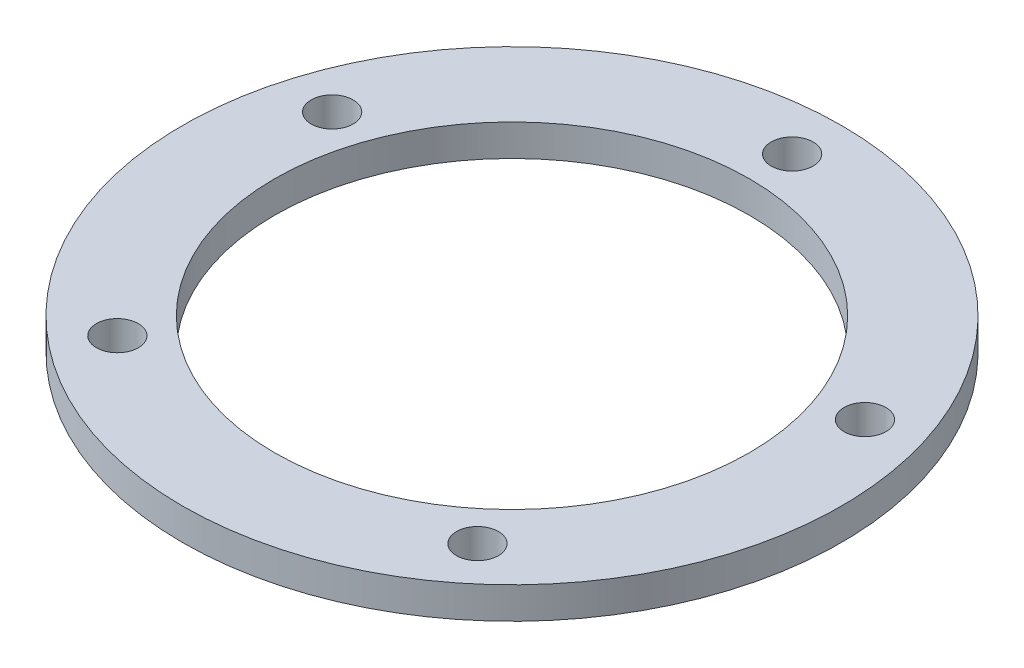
ISO-10303-21;
HEADER;
FILE_DESCRIPTION(('STEP AP214'),'2;1');
FILE_NAME('part.step','',(''),(''),'','','');
FILE_SCHEMA(('AUTOMOTIVE_DESIGN { 1 0 10303 214 1 1 1 1 }'));
ENDSEC;
DATA;
#1=APPLICATION_CONTEXT('core data for automotive mechanical design processes');
#2=APPLICATION_PROTOCOL_DEFINITION('international standard','automotive_design',2000,#1);
#3=PRODUCT_CONTEXT('',#1,'mechanical');
#4=PRODUCT('Part','Part','',(#3));
#5=PRODUCT_RELATED_PRODUCT_CATEGORY('part','',(#4));
#6=PRODUCT_DEFINITION_FORMATION('','',#4);
#7=PRODUCT_DEFINITION_CONTEXT('part definition',#1,'design');
#8=PRODUCT_DEFINITION('design','',#6,#7);
#9=PRODUCT_DEFINITION_SHAPE('','',#8);
#10=(LENGTH_UNIT() NAMED_UNIT(*) SI_UNIT(.MILLI.,.METRE.));
#11=(NAMED_UNIT(*) PLANE_ANGLE_UNIT() SI_UNIT($,.RADIAN.));
#12=(NAMED_UNIT(*) SI_UNIT($,.STERADIAN.) SOLID_ANGLE_UNIT());
#13=UNCERTAINTY_MEASURE_WITH_UNIT(LENGTH_MEASURE(1.E-05),#10,'distance_accuracy_value','');
#14=(GEOMETRIC_REPRESENTATION_CONTEXT(3) GLOBAL_UNCERTAINTY_ASSIGNED_CONTEXT((#13)) GLOBAL_UNIT_ASSIGNED_CONTEXT((#10,
#11,#12)) REPRESENTATION_CONTEXT('',''));
#15=CARTESIAN_POINT('',(0.,0.,0.));
#16=DIRECTION('',(0.,0.,1.));
#17=DIRECTION('',(1.,0.,0.));
#18=AXIS2_PLACEMENT_3D('',#15,#16,#17);
#19=CARTESIAN_POINT('',(0.,3.048,0.));
#20=DIRECTION('',(0.,1.,0.));
#21=DIRECTION('',(0.,0.,1.));
#22=AXIS2_PLACEMENT_3D('',#19,#20,#21);
#23=PLANE('',#22);
#24=CARTESIAN_POINT('',(0.,3.048,-26.9875));
#25=DIRECTION('',(0.,1.,0.));
#26=DIRECTION('',(0.,0.,1.));
#27=AXIS2_PLACEMENT_3D('',#24,#25,#26);
#28=CIRCLE('',#27,2.0193);
#29=CARTESIAN_POINT('',(0.,3.048,-24.9682));
#30=VERTEX_POINT('',#29);
#31=EDGE_CURVE('E47',#30,#30,#28,.T.);
#32=ORIENTED_EDGE('',*,*,#31,.F.);
#33=EDGE_LOOP('',(#32));
#34=FACE_BOUND('',#33,.T.);
#35=CARTESIAN_POINT('',(25.6666377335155,3.048,-8.33959613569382));
#36=DIRECTION('',(0.,1.,0.));
#37=DIRECTION('',(0.,0.,1.));
#38=AXIS2_PLACEMENT_3D('',#35,#36,#37);
#39=CIRCLE('',#38,2.0193);
#40=CARTESIAN_POINT('',(25.6666377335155,3.048,-6.32029613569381));
#41=VERTEX_POINT('',#40);
#42=EDGE_CURVE('E52',#41,#41,#39,.T.);
#43=ORIENTED_EDGE('',*,*,#42,.F.);
#44=EDGE_LOOP('',(#43));
#45=FACE_BOUND('',#44,.T.);
#46=CARTESIAN_POINT('',(17.3472306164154,3.048,20.6736244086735));
#47=DIRECTION('',(0.,1.,0.));
#48=DIRECTION('',(0.,0.,1.));
#49=AXIS2_PLACEMENT_3D('',#46,#47,#48);
#50=CIRCLE('',#49,2.0193);
#51=CARTESIAN_POINT('',(17.3472306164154,3.048,22.6929244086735));
#52=VERTEX_POINT('',#51);
#53=EDGE_CURVE('E55',#52,#52,#50,.T.);
#54=ORIENTED_EDGE('',*,*,#53,.F.);
#55=EDGE_LOOP('',(#54));
#56=FACE_BOUND('',#55,.T.);
#57=CARTESIAN_POINT('',(-17.3472306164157,3.048,20.6736244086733));
#58=DIRECTION('',(0.,1.,0.));
#59=DIRECTION('',(0.,0.,1.));
#60=AXIS2_PLACEMENT_3D('',#57,#58,#59);
#61=CIRCLE('',#60,2.0193);
#62=CARTESIAN_POINT('',(-17.3472306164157,3.048,22.6929244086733));
#63=VERTEX_POINT('',#62);
#64=EDGE_CURVE('E58',#63,#63,#61,.T.);
#65=ORIENTED_EDGE('',*,*,#64,.F.);
#66=EDGE_LOOP('',(#65));
#67=FACE_BOUND('',#66,.T.);
#68=CARTESIAN_POINT('',(-25.6666377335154,3.048,-8.33959613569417));
#69=DIRECTION('',(0.,1.,0.));
#70=DIRECTION('',(0.,0.,1.));
#71=AXIS2_PLACEMENT_3D('',#68,#69,#70);
#72=CIRCLE('',#71,2.0193);
#73=CARTESIAN_POINT('',(-25.6666377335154,3.048,-6.32029613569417));
#74=VERTEX_POINT('',#73);
#75=EDGE_CURVE('E61',#74,#74,#72,.T.);
#76=ORIENTED_EDGE('',*,*,#75,.F.);
#77=EDGE_LOOP('',(#76));
#78=FACE_BOUND('',#77,.T.);
#79=CARTESIAN_POINT('',(0.,3.048,0.));
#80=DIRECTION('',(0.,1.,0.));
#81=DIRECTION('',(0.,0.,1.));
#82=AXIS2_PLACEMENT_3D('',#79,#80,#81);
#83=CIRCLE('',#82,31.75);
#84=CARTESIAN_POINT('',(0.,3.048,-31.75));
#85=VERTEX_POINT('',#84);
#86=EDGE_CURVE('E10',#85,#85,#83,.T.);
#87=ORIENTED_EDGE('',*,*,#86,.T.);
#88=EDGE_LOOP('',(#87));
#89=FACE_BOUND('',#88,.T.);
#90=CARTESIAN_POINT('',(0.,3.048,0.));
#91=DIRECTION('',(0.,1.,0.));
#92=DIRECTION('',(0.,0.,1.));
#93=AXIS2_PLACEMENT_3D('',#90,#91,#92);
#94=CIRCLE('',#93,22.8685812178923);
#95=CARTESIAN_POINT('',(0.,3.048,-22.8685812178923));
#96=VERTEX_POINT('',#95);
#97=EDGE_CURVE('E42',#96,#96,#94,.T.);
#98=ORIENTED_EDGE('',*,*,#97,.F.);
#99=EDGE_LOOP('',(#98));
#100=FACE_BOUND('',#99,.T.);
#101=ADVANCED_FACE('F31',(#34,#45,#56,#67,#78,#89,#100),#23,.T.);
#102=CARTESIAN_POINT('',(0.,0.,0.));
#103=DIRECTION('',(0.,1.,0.));
#104=DIRECTION('',(0.,0.,1.));
#105=AXIS2_PLACEMENT_3D('',#102,#103,#104);
#106=PLANE('',#105);
#107=CARTESIAN_POINT('',(0.,0.,-26.9875));
#108=DIRECTION('',(0.,1.,0.));
#109=DIRECTION('',(0.,0.,1.));
#110=AXIS2_PLACEMENT_3D('',#107,#108,#109);
#111=CIRCLE('',#110,2.0193);
#112=CARTESIAN_POINT('',(0.,0.,-24.9682));
#113=VERTEX_POINT('',#112);
#114=EDGE_CURVE('E64',#113,#113,#111,.T.);
#115=ORIENTED_EDGE('',*,*,#114,.T.);
#116=EDGE_LOOP('',(#115));
#117=FACE_BOUND('',#116,.T.);
#118=CARTESIAN_POINT('',(25.6666377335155,0.,-8.33959613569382));
#119=DIRECTION('',(0.,1.,0.));
#120=DIRECTION('',(0.,0.,1.));
#121=AXIS2_PLACEMENT_3D('',#118,#119,#120);
#122=CIRCLE('',#121,2.0193);
#123=CARTESIAN_POINT('',(25.6666377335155,0.,-6.32029613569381));
#124=VERTEX_POINT('',#123);
#125=EDGE_CURVE('E74',#124,#124,#122,.T.);
#126=ORIENTED_EDGE('',*,*,#125,.T.);
#127=EDGE_LOOP('',(#126));
#128=FACE_BOUND('',#127,.T.);
#129=CARTESIAN_POINT('',(17.3472306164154,0.,20.6736244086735));
#130=DIRECTION('',(0.,1.,0.));
#131=DIRECTION('',(0.,0.,1.));
#132=AXIS2_PLACEMENT_3D('',#129,#130,#131);
#133=CIRCLE('',#132,2.0193);
#134=CARTESIAN_POINT('',(17.3472306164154,0.,22.6929244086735));
#135=VERTEX_POINT('',#134);
#136=EDGE_CURVE('E71',#135,#135,#133,.T.);
#137=ORIENTED_EDGE('',*,*,#136,.T.);
#138=EDGE_LOOP('',(#137));
#139=FACE_BOUND('',#138,.T.);
#140=CARTESIAN_POINT('',(-17.3472306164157,0.,20.6736244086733));
#141=DIRECTION('',(0.,1.,0.));
#142=DIRECTION('',(0.,0.,1.));
#143=AXIS2_PLACEMENT_3D('',#140,#141,#142);
#144=CIRCLE('',#143,2.0193);
#145=CARTESIAN_POINT('',(-17.3472306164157,0.,22.6929244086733));
#146=VERTEX_POINT('',#145);
#147=EDGE_CURVE('E68',#146,#146,#144,.T.);
#148=ORIENTED_EDGE('',*,*,#147,.T.);
#149=EDGE_LOOP('',(#148));
#150=FACE_BOUND('',#149,.T.);
#151=CARTESIAN_POINT('',(-25.6666377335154,0.,-8.33959613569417));
#152=DIRECTION('',(0.,1.,0.));
#153=DIRECTION('',(0.,0.,1.));
#154=AXIS2_PLACEMENT_3D('',#151,#152,#153);
#155=CIRCLE('',#154,2.0193);
#156=CARTESIAN_POINT('',(-25.6666377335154,0.,-6.32029613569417));
#157=VERTEX_POINT('',#156);
#158=EDGE_CURVE('E65',#157,#157,#155,.T.);
#159=ORIENTED_EDGE('',*,*,#158,.T.);
#160=EDGE_LOOP('',(#159));
#161=FACE_BOUND('',#160,.T.);
#162=CARTESIAN_POINT('',(0.,0.,0.));
#163=DIRECTION('',(0.,1.,0.));
#164=DIRECTION('',(0.,0.,1.));
#165=AXIS2_PLACEMENT_3D('',#162,#163,#164);
#166=CIRCLE('',#165,31.75);
#167=CARTESIAN_POINT('',(0.,0.,-31.75));
#168=VERTEX_POINT('',#167);
#169=EDGE_CURVE('E35',#168,#168,#166,.T.);
#170=ORIENTED_EDGE('',*,*,#169,.F.);
#171=EDGE_LOOP('',(#170));
#172=FACE_BOUND('',#171,.T.);
#173=CARTESIAN_POINT('',(0.,0.,0.));
#174=DIRECTION('',(0.,1.,0.));
#175=DIRECTION('',(0.,0.,1.));
#176=AXIS2_PLACEMENT_3D('',#173,#174,#175);
#177=CIRCLE('',#176,22.8685812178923);
#178=CARTESIAN_POINT('',(0.,0.,-22.8685812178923));
#179=VERTEX_POINT('',#178);
#180=EDGE_CURVE('E44',#179,#179,#177,.T.);
#181=ORIENTED_EDGE('',*,*,#180,.T.);
#182=EDGE_LOOP('',(#181));
#183=FACE_BOUND('',#182,.T.);
#184=ADVANCED_FACE('F80',(#117,#128,#139,#150,#161,#172,#183),#106,.F.);
#185=CARTESIAN_POINT('',(0.,3.048,0.));
#186=DIRECTION('',(0.,-1.,0.));
#187=DIRECTION('',(0.,0.,-1.));
#188=AXIS2_PLACEMENT_3D('',#185,#186,#187);
#189=CYLINDRICAL_SURFACE('',#188,31.75);
#190=CARTESIAN_POINT('',(0.,3.048,-31.75));
#191=CARTESIAN_POINT('',(0.,3.01625,-31.75));
#192=CARTESIAN_POINT('',(0.,2.9845,-31.75));
#193=CARTESIAN_POINT('',(0.,2.921,-31.75));
#194=CARTESIAN_POINT('',(0.,2.88925,-31.75));
#195=CARTESIAN_POINT('',(0.,2.82575,-31.75));
#196=CARTESIAN_POINT('',(0.,2.794,-31.75));
#197=CARTESIAN_POINT('',(0.,2.7305,-31.75));
#198=CARTESIAN_POINT('',(0.,2.69875,-31.75));
#199=CARTESIAN_POINT('',(0.,2.63525,-31.75));
#200=CARTESIAN_POINT('',(0.,2.6035,-31.75));
#201=CARTESIAN_POINT('',(0.,2.54,-31.75));
#202=CARTESIAN_POINT('',(0.,2.50825,-31.75));
#203=CARTESIAN_POINT('',(0.,2.44475,-31.75));
#204=CARTESIAN_POINT('',(0.,2.413,-31.75));
#205=CARTESIAN_POINT('',(0.,2.3495,-31.75));
#206=CARTESIAN_POINT('',(0.,2.31775,-31.75));
#207=CARTESIAN_POINT('',(0.,2.25425,-31.75));
#208=CARTESIAN_POINT('',(0.,2.2225,-31.75));
#209=CARTESIAN_POINT('',(0.,2.159,-31.75));
#210=CARTESIAN_POINT('',(0.,2.12725,-31.75));
#211=CARTESIAN_POINT('',(0.,2.06375,-31.75));
#212=CARTESIAN_POINT('',(0.,2.032,-31.75));
#213=CARTESIAN_POINT('',(0.,1.9685,-31.75));
#214=CARTESIAN_POINT('',(0.,1.93675,-31.75));
#215=CARTESIAN_POINT('',(0.,1.87325,-31.75));
#216=CARTESIAN_POINT('',(0.,1.8415,-31.75));
#217=CARTESIAN_POINT('',(0.,1.778,-31.75));
#218=CARTESIAN_POINT('',(0.,1.74625,-31.75));
#219=CARTESIAN_POINT('',(0.,1.68275,-31.75));
#220=CARTESIAN_POINT('',(0.,1.651,-31.75));
#221=CARTESIAN_POINT('',(0.,1.5875,-31.75));
#222=CARTESIAN_POINT('',(0.,1.55575,-31.75));
#223=CARTESIAN_POINT('',(0.,1.49225,-31.75));
#224=CARTESIAN_POINT('',(0.,1.4605,-31.75));
#225=CARTESIAN_POINT('',(0.,1.397,-31.75));
#226=CARTESIAN_POINT('',(0.,1.36525,-31.75));
#227=CARTESIAN_POINT('',(0.,1.30175,-31.75));
#228=CARTESIAN_POINT('',(0.,1.27,-31.75));
#229=CARTESIAN_POINT('',(0.,1.2065,-31.75));
#230=CARTESIAN_POINT('',(0.,1.17475,-31.75));
#231=CARTESIAN_POINT('',(0.,1.11125,-31.75));
#232=CARTESIAN_POINT('',(0.,1.0795,-31.75));
#233=CARTESIAN_POINT('',(0.,1.016,-31.75));
#234=CARTESIAN_POINT('',(0.,0.98425,-31.75));
#235=CARTESIAN_POINT('',(0.,0.92075,-31.75));
#236=CARTESIAN_POINT('',(0.,0.889,-31.75));
#237=CARTESIAN_POINT('',(0.,0.8255,-31.75));
#238=CARTESIAN_POINT('',(0.,0.79375,-31.75));
#239=CARTESIAN_POINT('',(0.,0.73025,-31.75));
#240=CARTESIAN_POINT('',(0.,0.6985,-31.75));
#241=CARTESIAN_POINT('',(0.,0.635,-31.75));
#242=CARTESIAN_POINT('',(0.,0.60325,-31.75));
#243=CARTESIAN_POINT('',(0.,0.53975,-31.75));
#244=CARTESIAN_POINT('',(0.,0.508,-31.75));
#245=CARTESIAN_POINT('',(0.,0.4445,-31.75));
#246=CARTESIAN_POINT('',(0.,0.41275,-31.75));
#247=CARTESIAN_POINT('',(0.,0.34925,-31.75));
#248=CARTESIAN_POINT('',(0.,0.3175,-31.75));
#249=CARTESIAN_POINT('',(0.,0.254,-31.75));
#250=CARTESIAN_POINT('',(0.,0.22225,-31.75));
#251=CARTESIAN_POINT('',(0.,0.15875,-31.75));
#252=CARTESIAN_POINT('',(0.,0.127,-31.75));
#253=CARTESIAN_POINT('',(0.,0.0634999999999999,-31.75));
#254=CARTESIAN_POINT('',(0.,0.03175,-31.75));
#255=CARTESIAN_POINT('',(0.,0.,-31.75));
#256=B_SPLINE_CURVE_WITH_KNOTS('',3,(#190,#191,#192,#193,#194,#195,#196,#197,#198,#199,#200,
#201,#202,#203,#204,#205,#206,#207,#208,#209,#210,#211,#212,#213,#214,#215,#216,#217,#218,#219,
#220,#221,#222,#223,#224,#225,#226,#227,#228,#229,#230,#231,#232,#233,#234,#235,#236,#237,#238,
#239,#240,#241,#242,#243,#244,#245,#246,#247,#248,#249,#250,#251,#252,#253,#254,#255),
.UNSPECIFIED.,.F.,.F.,(4,2,2,2,2,2,2,2,2,2,2,2,2,2,2,2,2,2,2,2,2,2,2,2,2,2,2,2,2,2,2,2,4),(0.,
0.0952499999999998,0.1905,0.28575,0.381,0.47625,0.5715,0.66675,0.762,0.85725,0.9525,1.04775,
1.143,1.23825,1.3335,1.42875,1.524,1.61925,1.7145,1.80975,1.905,2.00025,2.0955,2.19075,2.286,
2.38125,2.4765,2.57175,2.667,2.76225,2.8575,2.95275,3.048),.UNSPECIFIED.);
#257=EDGE_CURVE('BSEAM33',#85,#168,#256,.T.);
#258=ORIENTED_EDGE('',*,*,#86,.F.);
#259=ORIENTED_EDGE('',*,*,#169,.T.);
#260=ORIENTED_EDGE('',*,*,#257,.T.);
#261=ORIENTED_EDGE('',*,*,#257,.F.);
#262=EDGE_LOOP('',(#258,#260,#259,#261));
#263=FACE_BOUND('',#262,.T.);
#264=ADVANCED_FACE('F33',(#263),#189,.T.);
#265=CARTESIAN_POINT('',(0.,3.048,0.));
#266=DIRECTION('',(0.,-1.,0.));
#267=DIRECTION('',(0.,0.,-1.));
#268=AXIS2_PLACEMENT_3D('',#265,#266,#267);
#269=CYLINDRICAL_SURFACE('',#268,22.8685812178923);
#270=CARTESIAN_POINT('',(0.,3.048,-22.8685812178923));
#271=CARTESIAN_POINT('',(0.,3.01625,-22.8685812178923));
#272=CARTESIAN_POINT('',(0.,2.9845,-22.8685812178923));
#273=CARTESIAN_POINT('',(0.,2.921,-22.8685812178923));
#274=CARTESIAN_POINT('',(0.,2.88925,-22.8685812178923));
#275=CARTESIAN_POINT('',(0.,2.82575,-22.8685812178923));
#276=CARTESIAN_POINT('',(0.,2.794,-22.8685812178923));
#277=CARTESIAN_POINT('',(0.,2.7305,-22.8685812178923));
#278=CARTESIAN_POINT('',(0.,2.69875,-22.8685812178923));
#279=CARTESIAN_POINT('',(0.,2.63525,-22.8685812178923));
#280=CARTESIAN_POINT('',(0.,2.6035,-22.8685812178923));
#281=CARTESIAN_POINT('',(0.,2.54,-22.8685812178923));
#282=CARTESIAN_POINT('',(0.,2.50825,-22.8685812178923));
#283=CARTESIAN_POINT('',(0.,2.44475,-22.8685812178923));
#284=CARTESIAN_POINT('',(0.,2.413,-22.8685812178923));
#285=CARTESIAN_POINT('',(0.,2.3495,-22.8685812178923));
#286=CARTESIAN_POINT('',(0.,2.31775,-22.8685812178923));
#287=CARTESIAN_POINT('',(0.,2.25425,-22.8685812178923));
#288=CARTESIAN_POINT('',(0.,2.2225,-22.8685812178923));
#289=CARTESIAN_POINT('',(0.,2.159,-22.8685812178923));
#290=CARTESIAN_POINT('',(0.,2.12725,-22.8685812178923));
#291=CARTESIAN_POINT('',(0.,2.06375,-22.8685812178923));
#292=CARTESIAN_POINT('',(0.,2.032,-22.8685812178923));
#293=CARTESIAN_POINT('',(0.,1.9685,-22.8685812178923));
#294=CARTESIAN_POINT('',(0.,1.93675,-22.8685812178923));
#295=CARTESIAN_POINT('',(0.,1.87325,-22.8685812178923));
#296=CARTESIAN_POINT('',(0.,1.8415,-22.8685812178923));
#297=CARTESIAN_POINT('',(0.,1.778,-22.8685812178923));
#298=CARTESIAN_POINT('',(0.,1.74625,-22.8685812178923));
#299=CARTESIAN_POINT('',(0.,1.68275,-22.8685812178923));
#300=CARTESIAN_POINT('',(0.,1.651,-22.8685812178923));
#301=CARTESIAN_POINT('',(0.,1.5875,-22.8685812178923));
#302=CARTESIAN_POINT('',(0.,1.55575,-22.8685812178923));
#303=CARTESIAN_POINT('',(0.,1.49225,-22.8685812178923));
#304=CARTESIAN_POINT('',(0.,1.4605,-22.8685812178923));
#305=CARTESIAN_POINT('',(0.,1.397,-22.8685812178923));
#306=CARTESIAN_POINT('',(0.,1.36525,-22.8685812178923));
#307=CARTESIAN_POINT('',(0.,1.30175,-22.8685812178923));
#308=CARTESIAN_POINT('',(0.,1.27,-22.8685812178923));
#309=CARTESIAN_POINT('',(0.,1.2065,-22.8685812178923));
#310=CARTESIAN_POINT('',(0.,1.17475,-22.8685812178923));
#311=CARTESIAN_POINT('',(0.,1.11125,-22.8685812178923));
#312=CARTESIAN_POINT('',(0.,1.0795,-22.8685812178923));
#313=CARTESIAN_POINT('',(0.,1.016,-22.8685812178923));
#314=CARTESIAN_POINT('',(0.,0.98425,-22.8685812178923));
#315=CARTESIAN_POINT('',(0.,0.92075,-22.8685812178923));
#316=CARTESIAN_POINT('',(0.,0.889,-22.8685812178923));
#317=CARTESIAN_POINT('',(0.,0.8255,-22.8685812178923));
#318=CARTESIAN_POINT('',(0.,0.79375,-22.8685812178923));
#319=CARTESIAN_POINT('',(0.,0.73025,-22.8685812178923));
#320=CARTESIAN_POINT('',(0.,0.6985,-22.8685812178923));
#321=CARTESIAN_POINT('',(0.,0.635,-22.8685812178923));
#322=CARTESIAN_POINT('',(0.,0.60325,-22.8685812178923));
#323=CARTESIAN_POINT('',(0.,0.53975,-22.8685812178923));
#324=CARTESIAN_POINT('',(0.,0.508,-22.8685812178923));
#325=CARTESIAN_POINT('',(0.,0.4445,-22.8685812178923));
#326=CARTESIAN_POINT('',(0.,0.41275,-22.8685812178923));
#327=CARTESIAN_POINT('',(0.,0.34925,-22.8685812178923));
#328=CARTESIAN_POINT('',(0.,0.3175,-22.8685812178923));
#329=CARTESIAN_POINT('',(0.,0.254,-22.8685812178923));
#330=CARTESIAN_POINT('',(0.,0.22225,-22.8685812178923));
#331=CARTESIAN_POINT('',(0.,0.15875,-22.8685812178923));
#332=CARTESIAN_POINT('',(0.,0.127,-22.8685812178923));
#333=CARTESIAN_POINT('',(0.,0.0634999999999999,-22.8685812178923));
#334=CARTESIAN_POINT('',(0.,0.03175,-22.8685812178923));
#335=CARTESIAN_POINT('',(0.,0.,-22.8685812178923));
#336=B_SPLINE_CURVE_WITH_KNOTS('',3,(#270,#271,#272,#273,#274,#275,#276,#277,#278,#279,#280,
#281,#282,#283,#284,#285,#286,#287,#288,#289,#290,#291,#292,#293,#294,#295,#296,#297,#298,#299,
#300,#301,#302,#303,#304,#305,#306,#307,#308,#309,#310,#311,#312,#313,#314,#315,#316,#317,#318,
#319,#320,#321,#322,#323,#324,#325,#326,#327,#328,#329,#330,#331,#332,#333,#334,#335),
.UNSPECIFIED.,.F.,.F.,(4,2,2,2,2,2,2,2,2,2,2,2,2,2,2,2,2,2,2,2,2,2,2,2,2,2,2,2,2,2,2,2,4),(0.,
0.0952499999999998,0.1905,0.28575,0.381,0.47625,0.5715,0.66675,0.762,0.85725,0.9525,1.04775,
1.143,1.23825,1.3335,1.42875,1.524,1.61925,1.7145,1.80975,1.905,2.00025,2.0955,2.19075,2.286,
2.38125,2.4765,2.57175,2.667,2.76225,2.8575,2.95275,3.048),.UNSPECIFIED.);
#337=EDGE_CURVE('BSEAM103',#96,#179,#336,.T.);
#338=ORIENTED_EDGE('',*,*,#97,.T.);
#339=ORIENTED_EDGE('',*,*,#180,.F.);
#340=ORIENTED_EDGE('',*,*,#337,.T.);
#341=ORIENTED_EDGE('',*,*,#337,.F.);
#342=EDGE_LOOP('',(#338,#340,#339,#341));
#343=FACE_BOUND('',#342,.T.);
#344=ADVANCED_FACE('F103',(#343),#269,.F.);
#345=CARTESIAN_POINT('',(-25.6666377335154,0.,-8.33959613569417));
#346=DIRECTION('',(0.,1.,0.));
#347=DIRECTION('',(0.,0.,1.));
#348=AXIS2_PLACEMENT_3D('',#345,#346,#347);
#349=CYLINDRICAL_SURFACE('',#348,2.0193);
#350=CARTESIAN_POINT('',(-25.6666377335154,3.048,-6.32029613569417));
#351=CARTESIAN_POINT('',(-25.6666377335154,3.01625,-6.32029613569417));
#352=CARTESIAN_POINT('',(-25.6666377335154,2.9845,-6.32029613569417));
#353=CARTESIAN_POINT('',(-25.6666377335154,2.921,-6.32029613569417));
#354=CARTESIAN_POINT('',(-25.6666377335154,2.88925,-6.32029613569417));
#355=CARTESIAN_POINT('',(-25.6666377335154,2.82575,-6.32029613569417));
#356=CARTESIAN_POINT('',(-25.6666377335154,2.794,-6.32029613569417));
#357=CARTESIAN_POINT('',(-25.6666377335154,2.7305,-6.32029613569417));
#358=CARTESIAN_POINT('',(-25.6666377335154,2.69875,-6.32029613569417));
#359=CARTESIAN_POINT('',(-25.6666377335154,2.63525,-6.32029613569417));
#360=CARTESIAN_POINT('',(-25.6666377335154,2.6035,-6.32029613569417));
#361=CARTESIAN_POINT('',(-25.6666377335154,2.54,-6.32029613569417));
#362=CARTESIAN_POINT('',(-25.6666377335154,2.50825,-6.32029613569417));
#363=CARTESIAN_POINT('',(-25.6666377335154,2.44475,-6.32029613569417));
#364=CARTESIAN_POINT('',(-25.6666377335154,2.413,-6.32029613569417));
#365=CARTESIAN_POINT('',(-25.6666377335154,2.3495,-6.32029613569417));
#366=CARTESIAN_POINT('',(-25.6666377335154,2.31775,-6.32029613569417));
#367=CARTESIAN_POINT('',(-25.6666377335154,2.25425,-6.32029613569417));
#368=CARTESIAN_POINT('',(-25.6666377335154,2.2225,-6.32029613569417));
#369=CARTESIAN_POINT('',(-25.6666377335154,2.159,-6.32029613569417));
#370=CARTESIAN_POINT('',(-25.6666377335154,2.12725,-6.32029613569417));
#371=CARTESIAN_POINT('',(-25.6666377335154,2.06375,-6.32029613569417));
#372=CARTESIAN_POINT('',(-25.6666377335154,2.032,-6.32029613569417));
#373=CARTESIAN_POINT('',(-25.6666377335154,1.9685,-6.32029613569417));
#374=CARTESIAN_POINT('',(-25.6666377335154,1.93675,-6.32029613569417));
#375=CARTESIAN_POINT('',(-25.6666377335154,1.87325,-6.32029613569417));
#376=CARTESIAN_POINT('',(-25.6666377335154,1.8415,-6.32029613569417));
#377=CARTESIAN_POINT('',(-25.6666377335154,1.778,-6.32029613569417));
#378=CARTESIAN_POINT('',(-25.6666377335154,1.74625,-6.32029613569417));
#379=CARTESIAN_POINT('',(-25.6666377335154,1.68275,-6.32029613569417));
#380=CARTESIAN_POINT('',(-25.6666377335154,1.651,-6.32029613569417));
#381=CARTESIAN_POINT('',(-25.6666377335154,1.5875,-6.32029613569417));
#382=CARTESIAN_POINT('',(-25.6666377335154,1.55575,-6.32029613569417));
#383=CARTESIAN_POINT('',(-25.6666377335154,1.49225,-6.32029613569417));
#384=CARTESIAN_POINT('',(-25.6666377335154,1.4605,-6.32029613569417));
#385=CARTESIAN_POINT('',(-25.6666377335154,1.397,-6.32029613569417));
#386=CARTESIAN_POINT('',(-25.6666377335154,1.36525,-6.32029613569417));
#387=CARTESIAN_POINT('',(-25.6666377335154,1.30175,-6.32029613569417));
#388=CARTESIAN_POINT('',(-25.6666377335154,1.27,-6.32029613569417));
#389=CARTESIAN_POINT('',(-25.6666377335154,1.2065,-6.32029613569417));
#390=CARTESIAN_POINT('',(-25.6666377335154,1.17475,-6.32029613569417));
#391=CARTESIAN_POINT('',(-25.6666377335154,1.11125,-6.32029613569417));
#392=CARTESIAN_POINT('',(-25.6666377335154,1.0795,-6.32029613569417));
#393=CARTESIAN_POINT('',(-25.6666377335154,1.016,-6.32029613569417));
#394=CARTESIAN_POINT('',(-25.6666377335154,0.98425,-6.32029613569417));
#395=CARTESIAN_POINT('',(-25.6666377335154,0.92075,-6.32029613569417));
#396=CARTESIAN_POINT('',(-25.6666377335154,0.889,-6.32029613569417));
#397=CARTESIAN_POINT('',(-25.6666377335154,0.8255,-6.32029613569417));
#398=CARTESIAN_POINT('',(-25.6666377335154,0.79375,-6.32029613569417));
#399=CARTESIAN_POINT('',(-25.6666377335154,0.73025,-6.32029613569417));
#400=CARTESIAN_POINT('',(-25.6666377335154,0.6985,-6.32029613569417));
#401=CARTESIAN_POINT('',(-25.6666377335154,0.635,-6.32029613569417));
#402=CARTESIAN_POINT('',(-25.6666377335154,0.60325,-6.32029613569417));
#403=CARTESIAN_POINT('',(-25.6666377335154,0.53975,-6.32029613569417));
#404=CARTESIAN_POINT('',(-25.6666377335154,0.508,-6.32029613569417));
#405=CARTESIAN_POINT('',(-25.6666377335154,0.4445,-6.32029613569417));
#406=CARTESIAN_POINT('',(-25.6666377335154,0.41275,-6.32029613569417));
#407=CARTESIAN_POINT('',(-25.6666377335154,0.34925,-6.32029613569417));
#408=CARTESIAN_POINT('',(-25.6666377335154,0.3175,-6.32029613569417));
#409=CARTESIAN_POINT('',(-25.6666377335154,0.254,-6.32029613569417));
#410=CARTESIAN_POINT('',(-25.6666377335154,0.22225,-6.32029613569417));
#411=CARTESIAN_POINT('',(-25.6666377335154,0.15875,-6.32029613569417));
#412=CARTESIAN_POINT('',(-25.6666377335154,0.127,-6.32029613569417));
#413=CARTESIAN_POINT('',(-25.6666377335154,0.0634999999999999,-6.32029613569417));
#414=CARTESIAN_POINT('',(-25.6666377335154,0.03175,-6.32029613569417));
#415=CARTESIAN_POINT('',(-25.6666377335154,0.,-6.32029613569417));
#416=B_SPLINE_CURVE_WITH_KNOTS('',3,(#350,#351,#352,#353,#354,#355,#356,#357,#358,#359,#360,
#361,#362,#363,#364,#365,#366,#367,#368,#369,#370,#371,#372,#373,#374,#375,#376,#377,#378,#379,
#380,#381,#382,#383,#384,#385,#386,#387,#388,#389,#390,#391,#392,#393,#394,#395,#396,#397,#398,
#399,#400,#401,#402,#403,#404,#405,#406,#407,#408,#409,#410,#411,#412,#413,#414,#415),
.UNSPECIFIED.,.F.,.F.,(4,2,2,2,2,2,2,2,2,2,2,2,2,2,2,2,2,2,2,2,2,2,2,2,2,2,2,2,2,2,2,2,4),(0.,
0.0952499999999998,0.1905,0.28575,0.381,0.47625,0.5715,0.66675,0.762,0.85725,0.9525,1.04775,
1.143,1.23825,1.3335,1.42875,1.524,1.61925,1.7145,1.80975,1.905,2.00025,2.0955,2.19075,2.286,
2.38125,2.4765,2.57175,2.667,2.76225,2.8575,2.95275,3.048),.UNSPECIFIED.);
#417=EDGE_CURVE('BSEAM106',#74,#157,#416,.T.);
#418=ORIENTED_EDGE('',*,*,#75,.T.);
#419=ORIENTED_EDGE('',*,*,#158,.F.);
#420=ORIENTED_EDGE('',*,*,#417,.T.);
#421=ORIENTED_EDGE('',*,*,#417,.F.);
#422=EDGE_LOOP('',(#418,#420,#419,#421));
#423=FACE_BOUND('',#422,.T.);
#424=ADVANCED_FACE('F106',(#423),#349,.F.);
#425=CARTESIAN_POINT('',(-17.3472306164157,0.,20.6736244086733));
#426=DIRECTION('',(0.,1.,0.));
#427=DIRECTION('',(0.,0.,1.));
#428=AXIS2_PLACEMENT_3D('',#425,#426,#427);
#429=CYLINDRICAL_SURFACE('',#428,2.0193);
#430=CARTESIAN_POINT('',(-17.3472306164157,3.048,22.6929244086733));
#431=CARTESIAN_POINT('',(-17.3472306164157,3.01625,22.6929244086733));
#432=CARTESIAN_POINT('',(-17.3472306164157,2.9845,22.6929244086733));
#433=CARTESIAN_POINT('',(-17.3472306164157,2.921,22.6929244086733));
#434=CARTESIAN_POINT('',(-17.3472306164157,2.88925,22.6929244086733));
#435=CARTESIAN_POINT('',(-17.3472306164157,2.82575,22.6929244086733));
#436=CARTESIAN_POINT('',(-17.3472306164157,2.794,22.6929244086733));
#437=CARTESIAN_POINT('',(-17.3472306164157,2.7305,22.6929244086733));
#438=CARTESIAN_POINT('',(-17.3472306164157,2.69875,22.6929244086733));
#439=CARTESIAN_POINT('',(-17.3472306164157,2.63525,22.6929244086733));
#440=CARTESIAN_POINT('',(-17.3472306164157,2.6035,22.6929244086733));
#441=CARTESIAN_POINT('',(-17.3472306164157,2.54,22.6929244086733));
#442=CARTESIAN_POINT('',(-17.3472306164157,2.50825,22.6929244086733));
#443=CARTESIAN_POINT('',(-17.3472306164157,2.44475,22.6929244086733));
#444=CARTESIAN_POINT('',(-17.3472306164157,2.413,22.6929244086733));
#445=CARTESIAN_POINT('',(-17.3472306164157,2.3495,22.6929244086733));
#446=CARTESIAN_POINT('',(-17.3472306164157,2.31775,22.6929244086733));
#447=CARTESIAN_POINT('',(-17.3472306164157,2.25425,22.6929244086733));
#448=CARTESIAN_POINT('',(-17.3472306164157,2.2225,22.6929244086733));
#449=CARTESIAN_POINT('',(-17.3472306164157,2.159,22.6929244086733));
#450=CARTESIAN_POINT('',(-17.3472306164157,2.12725,22.6929244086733));
#451=CARTESIAN_POINT('',(-17.3472306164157,2.06375,22.6929244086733));
#452=CARTESIAN_POINT('',(-17.3472306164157,2.032,22.6929244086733));
#453=CARTESIAN_POINT('',(-17.3472306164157,1.9685,22.6929244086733));
#454=CARTESIAN_POINT('',(-17.3472306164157,1.93675,22.6929244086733));
#455=CARTESIAN_POINT('',(-17.3472306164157,1.87325,22.6929244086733));
#456=CARTESIAN_POINT('',(-17.3472306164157,1.8415,22.6929244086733));
#457=CARTESIAN_POINT('',(-17.3472306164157,1.778,22.6929244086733));
#458=CARTESIAN_POINT('',(-17.3472306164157,1.74625,22.6929244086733));
#459=CARTESIAN_POINT('',(-17.3472306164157,1.68275,22.6929244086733));
#460=CARTESIAN_POINT('',(-17.3472306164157,1.651,22.6929244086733));
#461=CARTESIAN_POINT('',(-17.3472306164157,1.5875,22.6929244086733));
#462=CARTESIAN_POINT('',(-17.3472306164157,1.55575,22.6929244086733));
#463=CARTESIAN_POINT('',(-17.3472306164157,1.49225,22.6929244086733));
#464=CARTESIAN_POINT('',(-17.3472306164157,1.4605,22.6929244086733));
#465=CARTESIAN_POINT('',(-17.3472306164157,1.397,22.6929244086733));
#466=CARTESIAN_POINT('',(-17.3472306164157,1.36525,22.6929244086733));
#467=CARTESIAN_POINT('',(-17.3472306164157,1.30175,22.6929244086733));
#468=CARTESIAN_POINT('',(-17.3472306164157,1.27,22.6929244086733));
#469=CARTESIAN_POINT('',(-17.3472306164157,1.2065,22.6929244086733));
#470=CARTESIAN_POINT('',(-17.3472306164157,1.17475,22.6929244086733));
#471=CARTESIAN_POINT('',(-17.3472306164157,1.11125,22.6929244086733));
#472=CARTESIAN_POINT('',(-17.3472306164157,1.0795,22.6929244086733));
#473=CARTESIAN_POINT('',(-17.3472306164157,1.016,22.6929244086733));
#474=CARTESIAN_POINT('',(-17.3472306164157,0.98425,22.6929244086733));
#475=CARTESIAN_POINT('',(-17.3472306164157,0.92075,22.6929244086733));
#476=CARTESIAN_POINT('',(-17.3472306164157,0.889,22.6929244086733));
#477=CARTESIAN_POINT('',(-17.3472306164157,0.8255,22.6929244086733));
#478=CARTESIAN_POINT('',(-17.3472306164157,0.79375,22.6929244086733));
#479=CARTESIAN_POINT('',(-17.3472306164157,0.73025,22.6929244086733));
#480=CARTESIAN_POINT('',(-17.3472306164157,0.6985,22.6929244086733));
#481=CARTESIAN_POINT('',(-17.3472306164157,0.635,22.6929244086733));
#482=CARTESIAN_POINT('',(-17.3472306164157,0.60325,22.6929244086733));
#483=CARTESIAN_POINT('',(-17.3472306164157,0.53975,22.6929244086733));
#484=CARTESIAN_POINT('',(-17.3472306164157,0.508,22.6929244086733));
#485=CARTESIAN_POINT('',(-17.3472306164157,0.4445,22.6929244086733));
#486=CARTESIAN_POINT('',(-17.3472306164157,0.41275,22.6929244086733));
#487=CARTESIAN_POINT('',(-17.3472306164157,0.34925,22.6929244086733));
#488=CARTESIAN_POINT('',(-17.3472306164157,0.3175,22.6929244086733));
#489=CARTESIAN_POINT('',(-17.3472306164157,0.254,22.6929244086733));
#490=CARTESIAN_POINT('',(-17.3472306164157,0.22225,22.6929244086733));
#491=CARTESIAN_POINT('',(-17.3472306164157,0.15875,22.6929244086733));
#492=CARTESIAN_POINT('',(-17.3472306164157,0.127,22.6929244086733));
#493=CARTESIAN_POINT('',(-17.3472306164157,0.0634999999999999,22.6929244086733));
#494=CARTESIAN_POINT('',(-17.3472306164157,0.03175,22.6929244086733));
#495=CARTESIAN_POINT('',(-17.3472306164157,0.,22.6929244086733));
#496=B_SPLINE_CURVE_WITH_KNOTS('',3,(#430,#431,#432,#433,#434,#435,#436,#437,#438,#439,#440,
#441,#442,#443,#444,#445,#446,#447,#448,#449,#450,#451,#452,#453,#454,#455,#456,#457,#458,#459,
#460,#461,#462,#463,#464,#465,#466,#467,#468,#469,#470,#471,#472,#473,#474,#475,#476,#477,#478,
#479,#480,#481,#482,#483,#484,#485,#486,#487,#488,#489,#490,#491,#492,#493,#494,#495),
.UNSPECIFIED.,.F.,.F.,(4,2,2,2,2,2,2,2,2,2,2,2,2,2,2,2,2,2,2,2,2,2,2,2,2,2,2,2,2,2,2,2,4),(0.,
0.0952499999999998,0.1905,0.28575,0.381,0.47625,0.5715,0.66675,0.762,0.85725,0.9525,1.04775,
1.143,1.23825,1.3335,1.42875,1.524,1.61925,1.7145,1.80975,1.905,2.00025,2.0955,2.19075,2.286,
2.38125,2.4765,2.57175,2.667,2.76225,2.8575,2.95275,3.048),.UNSPECIFIED.);
#497=EDGE_CURVE('BSEAM110',#63,#146,#496,.T.);
#498=ORIENTED_EDGE('',*,*,#64,.T.);
#499=ORIENTED_EDGE('',*,*,#147,.F.);
#500=ORIENTED_EDGE('',*,*,#497,.T.);
#501=ORIENTED_EDGE('',*,*,#497,.F.);
#502=EDGE_LOOP('',(#498,#500,#499,#501));
#503=FACE_BOUND('',#502,.T.);
#504=ADVANCED_FACE('F110',(#503),#429,.F.);
#505=CARTESIAN_POINT('',(17.3472306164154,0.,20.6736244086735));
#506=DIRECTION('',(0.,1.,0.));
#507=DIRECTION('',(0.,0.,1.));
#508=AXIS2_PLACEMENT_3D('',#505,#506,#507);
#509=CYLINDRICAL_SURFACE('',#508,2.0193);
#510=CARTESIAN_POINT('',(17.3472306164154,3.048,22.6929244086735));
#511=CARTESIAN_POINT('',(17.3472306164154,3.01625,22.6929244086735));
#512=CARTESIAN_POINT('',(17.3472306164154,2.9845,22.6929244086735));
#513=CARTESIAN_POINT('',(17.3472306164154,2.921,22.6929244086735));
#514=CARTESIAN_POINT('',(17.3472306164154,2.88925,22.6929244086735));
#515=CARTESIAN_POINT('',(17.3472306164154,2.82575,22.6929244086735));
#516=CARTESIAN_POINT('',(17.3472306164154,2.794,22.6929244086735));
#517=CARTESIAN_POINT('',(17.3472306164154,2.7305,22.6929244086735));
#518=CARTESIAN_POINT('',(17.3472306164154,2.69875,22.6929244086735));
#519=CARTESIAN_POINT('',(17.3472306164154,2.63525,22.6929244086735));
#520=CARTESIAN_POINT('',(17.3472306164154,2.6035,22.6929244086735));
#521=CARTESIAN_POINT('',(17.3472306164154,2.54,22.6929244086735));
#522=CARTESIAN_POINT('',(17.3472306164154,2.50825,22.6929244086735));
#523=CARTESIAN_POINT('',(17.3472306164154,2.44475,22.6929244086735));
#524=CARTESIAN_POINT('',(17.3472306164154,2.413,22.6929244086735));
#525=CARTESIAN_POINT('',(17.3472306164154,2.3495,22.6929244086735));
#526=CARTESIAN_POINT('',(17.3472306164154,2.31775,22.6929244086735));
#527=CARTESIAN_POINT('',(17.3472306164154,2.25425,22.6929244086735));
#528=CARTESIAN_POINT('',(17.3472306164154,2.2225,22.6929244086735));
#529=CARTESIAN_POINT('',(17.3472306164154,2.159,22.6929244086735));
#530=CARTESIAN_POINT('',(17.3472306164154,2.12725,22.6929244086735));
#531=CARTESIAN_POINT('',(17.3472306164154,2.06375,22.6929244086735));
#532=CARTESIAN_POINT('',(17.3472306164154,2.032,22.6929244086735));
#533=CARTESIAN_POINT('',(17.3472306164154,1.9685,22.6929244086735));
#534=CARTESIAN_POINT('',(17.3472306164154,1.93675,22.6929244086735));
#535=CARTESIAN_POINT('',(17.3472306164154,1.87325,22.6929244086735));
#536=CARTESIAN_POINT('',(17.3472306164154,1.8415,22.6929244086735));
#537=CARTESIAN_POINT('',(17.3472306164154,1.778,22.6929244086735));
#538=CARTESIAN_POINT('',(17.3472306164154,1.74625,22.6929244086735));
#539=CARTESIAN_POINT('',(17.3472306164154,1.68275,22.6929244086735));
#540=CARTESIAN_POINT('',(17.3472306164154,1.651,22.6929244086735));
#541=CARTESIAN_POINT('',(17.3472306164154,1.5875,22.6929244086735));
#542=CARTESIAN_POINT('',(17.3472306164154,1.55575,22.6929244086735));
#543=CARTESIAN_POINT('',(17.3472306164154,1.49225,22.6929244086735));
#544=CARTESIAN_POINT('',(17.3472306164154,1.4605,22.6929244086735));
#545=CARTESIAN_POINT('',(17.3472306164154,1.397,22.6929244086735));
#546=CARTESIAN_POINT('',(17.3472306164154,1.36525,22.6929244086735));
#547=CARTESIAN_POINT('',(17.3472306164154,1.30175,22.6929244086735));
#548=CARTESIAN_POINT('',(17.3472306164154,1.27,22.6929244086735));
#549=CARTESIAN_POINT('',(17.3472306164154,1.2065,22.6929244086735));
#550=CARTESIAN_POINT('',(17.3472306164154,1.17475,22.6929244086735));
#551=CARTESIAN_POINT('',(17.3472306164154,1.11125,22.6929244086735));
#552=CARTESIAN_POINT('',(17.3472306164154,1.0795,22.6929244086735));
#553=CARTESIAN_POINT('',(17.3472306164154,1.016,22.6929244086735));
#554=CARTESIAN_POINT('',(17.3472306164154,0.98425,22.6929244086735));
#555=CARTESIAN_POINT('',(17.3472306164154,0.92075,22.6929244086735));
#556=CARTESIAN_POINT('',(17.3472306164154,0.889,22.6929244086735));
#557=CARTESIAN_POINT('',(17.3472306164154,0.8255,22.6929244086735));
#558=CARTESIAN_POINT('',(17.3472306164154,0.79375,22.6929244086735));
#559=CARTESIAN_POINT('',(17.3472306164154,0.73025,22.6929244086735));
#560=CARTESIAN_POINT('',(17.3472306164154,0.6985,22.6929244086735));
#561=CARTESIAN_POINT('',(17.3472306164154,0.635,22.6929244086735));
#562=CARTESIAN_POINT('',(17.3472306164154,0.60325,22.6929244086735));
#563=CARTESIAN_POINT('',(17.3472306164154,0.53975,22.6929244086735));
#564=CARTESIAN_POINT('',(17.3472306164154,0.508,22.6929244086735));
#565=CARTESIAN_POINT('',(17.3472306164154,0.4445,22.6929244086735));
#566=CARTESIAN_POINT('',(17.3472306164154,0.41275,22.6929244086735));
#567=CARTESIAN_POINT('',(17.3472306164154,0.34925,22.6929244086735));
#568=CARTESIAN_POINT('',(17.3472306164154,0.3175,22.6929244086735));
#569=CARTESIAN_POINT('',(17.3472306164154,0.254,22.6929244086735));
#570=CARTESIAN_POINT('',(17.3472306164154,0.22225,22.6929244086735));
#571=CARTESIAN_POINT('',(17.3472306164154,0.15875,22.6929244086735));
#572=CARTESIAN_POINT('',(17.3472306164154,0.127,22.6929244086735));
#573=CARTESIAN_POINT('',(17.3472306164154,0.0634999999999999,22.6929244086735));
#574=CARTESIAN_POINT('',(17.3472306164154,0.03175,22.6929244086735));
#575=CARTESIAN_POINT('',(17.3472306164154,0.,22.6929244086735));
#576=B_SPLINE_CURVE_WITH_KNOTS('',3,(#510,#511,#512,#513,#514,#515,#516,#517,#518,#519,#520,
#521,#522,#523,#524,#525,#526,#527,#528,#529,#530,#531,#532,#533,#534,#535,#536,#537,#538,#539,
#540,#541,#542,#543,#544,#545,#546,#547,#548,#549,#550,#551,#552,#553,#554,#555,#556,#557,#558,
#559,#560,#561,#562,#563,#564,#565,#566,#567,#568,#569,#570,#571,#572,#573,#574,#575),
.UNSPECIFIED.,.F.,.F.,(4,2,2,2,2,2,2,2,2,2,2,2,2,2,2,2,2,2,2,2,2,2,2,2,2,2,2,2,2,2,2,2,4),(0.,
0.0952499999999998,0.1905,0.28575,0.381,0.47625,0.5715,0.66675,0.762,0.85725,0.9525,1.04775,
1.143,1.23825,1.3335,1.42875,1.524,1.61925,1.7145,1.80975,1.905,2.00025,2.0955,2.19075,2.286,
2.38125,2.4765,2.57175,2.667,2.76225,2.8575,2.95275,3.048),.UNSPECIFIED.);
#577=EDGE_CURVE('BSEAM91',#52,#135,#576,.T.);
#578=ORIENTED_EDGE('',*,*,#53,.T.);
#579=ORIENTED_EDGE('',*,*,#136,.F.);
#580=ORIENTED_EDGE('',*,*,#577,.T.);
#581=ORIENTED_EDGE('',*,*,#577,.F.);
#582=EDGE_LOOP('',(#578,#580,#579,#581));
#583=FACE_BOUND('',#582,.T.);
#584=ADVANCED_FACE('F91',(#583),#509,.F.);
#585=CARTESIAN_POINT('',(25.6666377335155,0.,-8.33959613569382));
#586=DIRECTION('',(0.,1.,0.));
#587=DIRECTION('',(0.,0.,1.));
#588=AXIS2_PLACEMENT_3D('',#585,#586,#587);
#589=CYLINDRICAL_SURFACE('',#588,2.0193);
#590=CARTESIAN_POINT('',(25.6666377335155,3.048,-6.32029613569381));
#591=CARTESIAN_POINT('',(25.6666377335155,3.01625,-6.32029613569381));
#592=CARTESIAN_POINT('',(25.6666377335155,2.9845,-6.32029613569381));
#593=CARTESIAN_POINT('',(25.6666377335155,2.921,-6.32029613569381));
#594=CARTESIAN_POINT('',(25.6666377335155,2.88925,-6.32029613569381));
#595=CARTESIAN_POINT('',(25.6666377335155,2.82575,-6.32029613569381));
#596=CARTESIAN_POINT('',(25.6666377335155,2.794,-6.32029613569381));
#597=CARTESIAN_POINT('',(25.6666377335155,2.7305,-6.32029613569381));
#598=CARTESIAN_POINT('',(25.6666377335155,2.69875,-6.32029613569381));
#599=CARTESIAN_POINT('',(25.6666377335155,2.63525,-6.32029613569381));
#600=CARTESIAN_POINT('',(25.6666377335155,2.6035,-6.32029613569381));
#601=CARTESIAN_POINT('',(25.6666377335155,2.54,-6.32029613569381));
#602=CARTESIAN_POINT('',(25.6666377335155,2.50825,-6.32029613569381));
#603=CARTESIAN_POINT('',(25.6666377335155,2.44475,-6.32029613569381));
#604=CARTESIAN_POINT('',(25.6666377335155,2.413,-6.32029613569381));
#605=CARTESIAN_POINT('',(25.6666377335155,2.3495,-6.32029613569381));
#606=CARTESIAN_POINT('',(25.6666377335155,2.31775,-6.32029613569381));
#607=CARTESIAN_POINT('',(25.6666377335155,2.25425,-6.32029613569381));
#608=CARTESIAN_POINT('',(25.6666377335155,2.2225,-6.32029613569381));
#609=CARTESIAN_POINT('',(25.6666377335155,2.159,-6.32029613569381));
#610=CARTESIAN_POINT('',(25.6666377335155,2.12725,-6.32029613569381));
#611=CARTESIAN_POINT('',(25.6666377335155,2.06375,-6.32029613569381));
#612=CARTESIAN_POINT('',(25.6666377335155,2.032,-6.32029613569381));
#613=CARTESIAN_POINT('',(25.6666377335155,1.9685,-6.32029613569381));
#614=CARTESIAN_POINT('',(25.6666377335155,1.93675,-6.32029613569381));
#615=CARTESIAN_POINT('',(25.6666377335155,1.87325,-6.32029613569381));
#616=CARTESIAN_POINT('',(25.6666377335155,1.8415,-6.32029613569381));
#617=CARTESIAN_POINT('',(25.6666377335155,1.778,-6.32029613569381));
#618=CARTESIAN_POINT('',(25.6666377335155,1.74625,-6.32029613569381));
#619=CARTESIAN_POINT('',(25.6666377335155,1.68275,-6.32029613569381));
#620=CARTESIAN_POINT('',(25.6666377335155,1.651,-6.32029613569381));
#621=CARTESIAN_POINT('',(25.6666377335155,1.5875,-6.32029613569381));
#622=CARTESIAN_POINT('',(25.6666377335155,1.55575,-6.32029613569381));
#623=CARTESIAN_POINT('',(25.6666377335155,1.49225,-6.32029613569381));
#624=CARTESIAN_POINT('',(25.6666377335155,1.4605,-6.32029613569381));
#625=CARTESIAN_POINT('',(25.6666377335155,1.397,-6.32029613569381));
#626=CARTESIAN_POINT('',(25.6666377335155,1.36525,-6.32029613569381));
#627=CARTESIAN_POINT('',(25.6666377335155,1.30175,-6.32029613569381));
#628=CARTESIAN_POINT('',(25.6666377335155,1.27,-6.32029613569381));
#629=CARTESIAN_POINT('',(25.6666377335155,1.2065,-6.32029613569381));
#630=CARTESIAN_POINT('',(25.6666377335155,1.17475,-6.32029613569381));
#631=CARTESIAN_POINT('',(25.6666377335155,1.11125,-6.32029613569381));
#632=CARTESIAN_POINT('',(25.6666377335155,1.0795,-6.32029613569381));
#633=CARTESIAN_POINT('',(25.6666377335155,1.016,-6.32029613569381));
#634=CARTESIAN_POINT('',(25.6666377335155,0.98425,-6.32029613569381));
#635=CARTESIAN_POINT('',(25.6666377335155,0.92075,-6.32029613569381));
#636=CARTESIAN_POINT('',(25.6666377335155,0.889,-6.32029613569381));
#637=CARTESIAN_POINT('',(25.6666377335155,0.8255,-6.32029613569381));
#638=CARTESIAN_POINT('',(25.6666377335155,0.79375,-6.32029613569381));
#639=CARTESIAN_POINT('',(25.6666377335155,0.73025,-6.32029613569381));
#640=CARTESIAN_POINT('',(25.6666377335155,0.6985,-6.32029613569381));
#641=CARTESIAN_POINT('',(25.6666377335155,0.635,-6.32029613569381));
#642=CARTESIAN_POINT('',(25.6666377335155,0.60325,-6.32029613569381));
#643=CARTESIAN_POINT('',(25.6666377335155,0.53975,-6.32029613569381));
#644=CARTESIAN_POINT('',(25.6666377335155,0.508,-6.32029613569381));
#645=CARTESIAN_POINT('',(25.6666377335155,0.4445,-6.32029613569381));
#646=CARTESIAN_POINT('',(25.6666377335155,0.41275,-6.32029613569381));
#647=CARTESIAN_POINT('',(25.6666377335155,0.34925,-6.32029613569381));
#648=CARTESIAN_POINT('',(25.6666377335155,0.3175,-6.32029613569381));
#649=CARTESIAN_POINT('',(25.6666377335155,0.254,-6.32029613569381));
#650=CARTESIAN_POINT('',(25.6666377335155,0.22225,-6.32029613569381));
#651=CARTESIAN_POINT('',(25.6666377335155,0.15875,-6.32029613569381));
#652=CARTESIAN_POINT('',(25.6666377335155,0.127,-6.32029613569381));
#653=CARTESIAN_POINT('',(25.6666377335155,0.0634999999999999,-6.32029613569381));
#654=CARTESIAN_POINT('',(25.6666377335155,0.03175,-6.32029613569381));
#655=CARTESIAN_POINT('',(25.6666377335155,0.,-6.32029613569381));
#656=B_SPLINE_CURVE_WITH_KNOTS('',3,(#590,#591,#592,#593,#594,#595,#596,#597,#598,#599,#600,
#601,#602,#603,#604,#605,#606,#607,#608,#609,#610,#611,#612,#613,#614,#615,#616,#617,#618,#619,
#620,#621,#622,#623,#624,#625,#626,#627,#628,#629,#630,#631,#632,#633,#634,#635,#636,#637,#638,
#639,#640,#641,#642,#643,#644,#645,#646,#647,#648,#649,#650,#651,#652,#653,#654,#655),
.UNSPECIFIED.,.F.,.F.,(4,2,2,2,2,2,2,2,2,2,2,2,2,2,2,2,2,2,2,2,2,2,2,2,2,2,2,2,2,2,2,2,4),(0.,
0.0952499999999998,0.1905,0.28575,0.381,0.47625,0.5715,0.66675,0.762,0.85725,0.9525,1.04775,
1.143,1.23825,1.3335,1.42875,1.524,1.61925,1.7145,1.80975,1.905,2.00025,2.0955,2.19075,2.286,
2.38125,2.4765,2.57175,2.667,2.76225,2.8575,2.95275,3.048),.UNSPECIFIED.);
#657=EDGE_CURVE('BSEAM85',#41,#124,#656,.T.);
#658=ORIENTED_EDGE('',*,*,#42,.T.);
#659=ORIENTED_EDGE('',*,*,#125,.F.);
#660=ORIENTED_EDGE('',*,*,#657,.T.);
#661=ORIENTED_EDGE('',*,*,#657,.F.);
#662=EDGE_LOOP('',(#658,#660,#659,#661));
#663=FACE_BOUND('',#662,.T.);
#664=ADVANCED_FACE('F85',(#663),#589,.F.);
#665=CARTESIAN_POINT('',(0.,0.,-26.9875));
#666=DIRECTION('',(0.,1.,0.));
#667=DIRECTION('',(0.,0.,1.));
#668=AXIS2_PLACEMENT_3D('',#665,#666,#667);
#669=CYLINDRICAL_SURFACE('',#668,2.0193);
#670=CARTESIAN_POINT('',(0.,3.048,-24.9682));
#671=CARTESIAN_POINT('',(0.,3.01625,-24.9682));
#672=CARTESIAN_POINT('',(0.,2.9845,-24.9682));
#673=CARTESIAN_POINT('',(0.,2.921,-24.9682));
#674=CARTESIAN_POINT('',(0.,2.88925,-24.9682));
#675=CARTESIAN_POINT('',(0.,2.82575,-24.9682));
#676=CARTESIAN_POINT('',(0.,2.794,-24.9682));
#677=CARTESIAN_POINT('',(0.,2.7305,-24.9682));
#678=CARTESIAN_POINT('',(0.,2.69875,-24.9682));
#679=CARTESIAN_POINT('',(0.,2.63525,-24.9682));
#680=CARTESIAN_POINT('',(0.,2.6035,-24.9682));
#681=CARTESIAN_POINT('',(0.,2.54,-24.9682));
#682=CARTESIAN_POINT('',(0.,2.50825,-24.9682));
#683=CARTESIAN_POINT('',(0.,2.44475,-24.9682));
#684=CARTESIAN_POINT('',(0.,2.413,-24.9682));
#685=CARTESIAN_POINT('',(0.,2.3495,-24.9682));
#686=CARTESIAN_POINT('',(0.,2.31775,-24.9682));
#687=CARTESIAN_POINT('',(0.,2.25425,-24.9682));
#688=CARTESIAN_POINT('',(0.,2.2225,-24.9682));
#689=CARTESIAN_POINT('',(0.,2.159,-24.9682));
#690=CARTESIAN_POINT('',(0.,2.12725,-24.9682));
#691=CARTESIAN_POINT('',(0.,2.06375,-24.9682));
#692=CARTESIAN_POINT('',(0.,2.032,-24.9682));
#693=CARTESIAN_POINT('',(0.,1.9685,-24.9682));
#694=CARTESIAN_POINT('',(0.,1.93675,-24.9682));
#695=CARTESIAN_POINT('',(0.,1.87325,-24.9682));
#696=CARTESIAN_POINT('',(0.,1.8415,-24.9682));
#697=CARTESIAN_POINT('',(0.,1.778,-24.9682));
#698=CARTESIAN_POINT('',(0.,1.74625,-24.9682));
#699=CARTESIAN_POINT('',(0.,1.68275,-24.9682));
#700=CARTESIAN_POINT('',(0.,1.651,-24.9682));
#701=CARTESIAN_POINT('',(0.,1.5875,-24.9682));
#702=CARTESIAN_POINT('',(0.,1.55575,-24.9682));
#703=CARTESIAN_POINT('',(0.,1.49225,-24.9682));
#704=CARTESIAN_POINT('',(0.,1.4605,-24.9682));
#705=CARTESIAN_POINT('',(0.,1.397,-24.9682));
#706=CARTESIAN_POINT('',(0.,1.36525,-24.9682));
#707=CARTESIAN_POINT('',(0.,1.30175,-24.9682));
#708=CARTESIAN_POINT('',(0.,1.27,-24.9682));
#709=CARTESIAN_POINT('',(0.,1.2065,-24.9682));
#710=CARTESIAN_POINT('',(0.,1.17475,-24.9682));
#711=CARTESIAN_POINT('',(0.,1.11125,-24.9682));
#712=CARTESIAN_POINT('',(0.,1.0795,-24.9682));
#713=CARTESIAN_POINT('',(0.,1.016,-24.9682));
#714=CARTESIAN_POINT('',(0.,0.98425,-24.9682));
#715=CARTESIAN_POINT('',(0.,0.92075,-24.9682));
#716=CARTESIAN_POINT('',(0.,0.889,-24.9682));
#717=CARTESIAN_POINT('',(0.,0.8255,-24.9682));
#718=CARTESIAN_POINT('',(0.,0.79375,-24.9682));
#719=CARTESIAN_POINT('',(0.,0.73025,-24.9682));
#720=CARTESIAN_POINT('',(0.,0.6985,-24.9682));
#721=CARTESIAN_POINT('',(0.,0.635,-24.9682));
#722=CARTESIAN_POINT('',(0.,0.60325,-24.9682));
#723=CARTESIAN_POINT('',(0.,0.53975,-24.9682));
#724=CARTESIAN_POINT('',(0.,0.508,-24.9682));
#725=CARTESIAN_POINT('',(0.,0.4445,-24.9682));
#726=CARTESIAN_POINT('',(0.,0.41275,-24.9682));
#727=CARTESIAN_POINT('',(0.,0.34925,-24.9682));
#728=CARTESIAN_POINT('',(0.,0.3175,-24.9682));
#729=CARTESIAN_POINT('',(0.,0.254,-24.9682));
#730=CARTESIAN_POINT('',(0.,0.22225,-24.9682));
#731=CARTESIAN_POINT('',(0.,0.15875,-24.9682));
#732=CARTESIAN_POINT('',(0.,0.127,-24.9682));
#733=CARTESIAN_POINT('',(0.,0.0634999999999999,-24.9682));
#734=CARTESIAN_POINT('',(0.,0.03175,-24.9682));
#735=CARTESIAN_POINT('',(0.,0.,-24.9682));
#736=B_SPLINE_CURVE_WITH_KNOTS('',3,(#670,#671,#672,#673,#674,#675,#676,#677,#678,#679,#680,
#681,#682,#683,#684,#685,#686,#687,#688,#689,#690,#691,#692,#693,#694,#695,#696,#697,#698,#699,
#700,#701,#702,#703,#704,#705,#706,#707,#708,#709,#710,#711,#712,#713,#714,#715,#716,#717,#718,
#719,#720,#721,#722,#723,#724,#725,#726,#727,#728,#729,#730,#731,#732,#733,#734,#735),
.UNSPECIFIED.,.F.,.F.,(4,2,2,2,2,2,2,2,2,2,2,2,2,2,2,2,2,2,2,2,2,2,2,2,2,2,2,2,2,2,2,2,4),(0.,
0.0952499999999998,0.1905,0.28575,0.381,0.47625,0.5715,0.66675,0.762,0.85725,0.9525,1.04775,
1.143,1.23825,1.3335,1.42875,1.524,1.61925,1.7145,1.80975,1.905,2.00025,2.0955,2.19075,2.286,
2.38125,2.4765,2.57175,2.667,2.76225,2.8575,2.95275,3.048),.UNSPECIFIED.);
#737=EDGE_CURVE('BSEAM83',#30,#113,#736,.T.);
#738=ORIENTED_EDGE('',*,*,#31,.T.);
#739=ORIENTED_EDGE('',*,*,#114,.F.);
#740=ORIENTED_EDGE('',*,*,#737,.T.);
#741=ORIENTED_EDGE('',*,*,#737,.F.);
#742=EDGE_LOOP('',(#738,#740,#739,#741));
#743=FACE_BOUND('',#742,.T.);
#744=ADVANCED_FACE('F83',(#743),#669,.F.);
#745=CLOSED_SHELL('',(#101,#184,#264,#344,#424,#504,#584,#664,#744));
#746=MANIFOLD_SOLID_BREP('B2',#745);
#747=ADVANCED_BREP_SHAPE_REPRESENTATION('',(#18,#746),#14);
#748=SHAPE_DEFINITION_REPRESENTATION(#9,#747);
ENDSEC;
END-ISO-10303-21;
